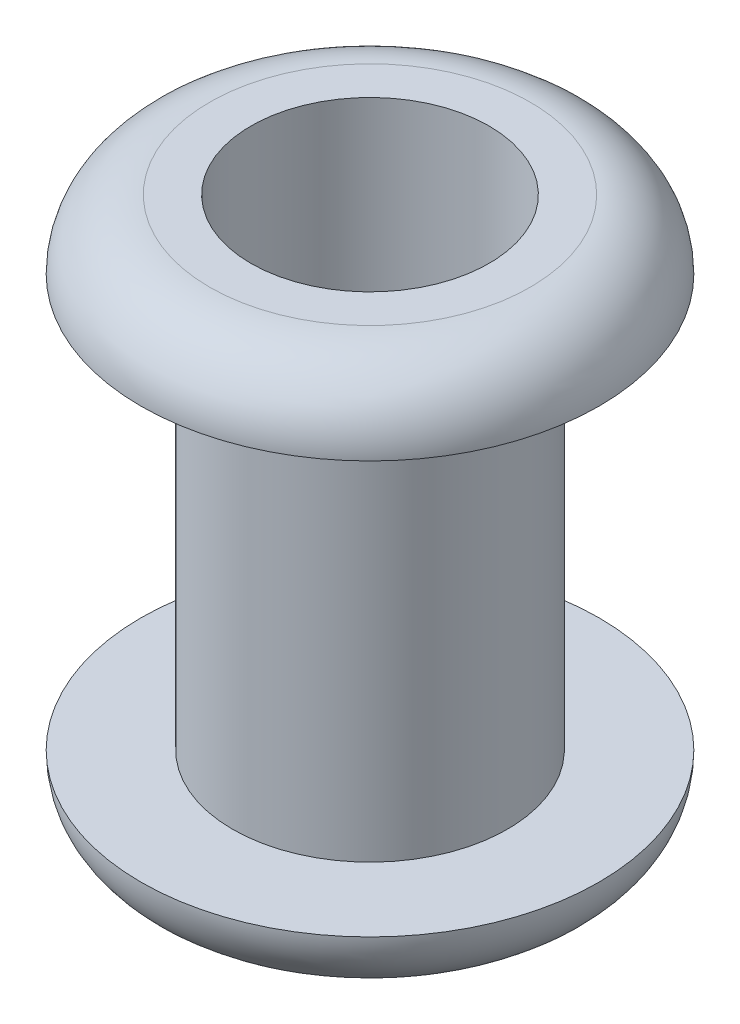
ISO-10303-21;
HEADER;
FILE_DESCRIPTION(('STEP AP214'),'2;1');
FILE_NAME('part.step','',(''),(''),'','','');
FILE_SCHEMA(('AUTOMOTIVE_DESIGN { 1 0 10303 214 1 1 1 1 }'));
ENDSEC;
DATA;
#1=APPLICATION_CONTEXT('core data for automotive mechanical design processes');
#2=APPLICATION_PROTOCOL_DEFINITION('international standard','automotive_design',2000,#1);
#3=PRODUCT_CONTEXT('',#1,'mechanical');
#4=PRODUCT('Part','Part','',(#3));
#5=PRODUCT_RELATED_PRODUCT_CATEGORY('part','',(#4));
#6=PRODUCT_DEFINITION_FORMATION('','',#4);
#7=PRODUCT_DEFINITION_CONTEXT('part definition',#1,'design');
#8=PRODUCT_DEFINITION('design','',#6,#7);
#9=PRODUCT_DEFINITION_SHAPE('','',#8);
#10=(LENGTH_UNIT() NAMED_UNIT(*) SI_UNIT(.MILLI.,.METRE.));
#11=(NAMED_UNIT(*) PLANE_ANGLE_UNIT() SI_UNIT($,.RADIAN.));
#12=(NAMED_UNIT(*) SI_UNIT($,.STERADIAN.) SOLID_ANGLE_UNIT());
#13=UNCERTAINTY_MEASURE_WITH_UNIT(LENGTH_MEASURE(1.E-05),#10,'distance_accuracy_value','');
#14=(GEOMETRIC_REPRESENTATION_CONTEXT(3) GLOBAL_UNCERTAINTY_ASSIGNED_CONTEXT((#13)) GLOBAL_UNIT_ASSIGNED_CONTEXT((#10,
#11,#12)) REPRESENTATION_CONTEXT('',''));
#15=CARTESIAN_POINT('',(0.,0.,0.));
#16=DIRECTION('',(0.,0.,1.));
#17=DIRECTION('',(1.,0.,0.));
#18=AXIS2_PLACEMENT_3D('',#15,#16,#17);
#19=CARTESIAN_POINT('',(0.,4.5,0.));
#20=DIRECTION('',(0.,-1.,0.));
#21=DIRECTION('',(0.,0.,-1.));
#22=AXIS2_PLACEMENT_3D('',#19,#20,#21);
#23=CYLINDRICAL_SURFACE('',#22,1.5);
#24=CARTESIAN_POINT('',(0.,4.5,0.));
#25=DIRECTION('',(0.,1.,0.));
#26=DIRECTION('',(0.,0.,1.));
#27=AXIS2_PLACEMENT_3D('',#24,#25,#26);
#28=CIRCLE('',#27,1.5);
#29=CARTESIAN_POINT('',(0.,4.5,1.5));
#30=VERTEX_POINT('',#29);
#31=EDGE_CURVE('E40',#30,#30,#28,.T.);
#32=ORIENTED_EDGE('',*,*,#31,.F.);
#33=EDGE_LOOP('',(#32));
#34=FACE_BOUND('',#33,.T.);
#35=CARTESIAN_POINT('',(0.,0.,0.));
#36=DIRECTION('',(0.,-1.,0.));
#37=DIRECTION('',(0.,0.,-1.));
#38=AXIS2_PLACEMENT_3D('',#35,#36,#37);
#39=CIRCLE('',#38,1.5);
#40=CARTESIAN_POINT('',(0.,0.,-1.5));
#41=VERTEX_POINT('',#40);
#42=EDGE_CURVE('E49',#41,#41,#39,.T.);
#43=ORIENTED_EDGE('',*,*,#42,.F.);
#44=EDGE_LOOP('',(#43));
#45=FACE_BOUND('',#44,.T.);
#46=ADVANCED_FACE('F29',(#34,#45),#23,.T.);
#47=CARTESIAN_POINT('',(0.,4.5,0.));
#48=DIRECTION('',(0.,1.,0.));
#49=DIRECTION('',(0.,0.,1.));
#50=AXIS2_PLACEMENT_3D('',#47,#48,#49);
#51=PLANE('',#50);
#52=CARTESIAN_POINT('',(0.,4.5,0.));
#53=DIRECTION('',(0.,1.,0.));
#54=DIRECTION('',(0.,0.,1.));
#55=AXIS2_PLACEMENT_3D('',#52,#53,#54);
#56=CIRCLE('',#55,2.5);
#57=CARTESIAN_POINT('',(0.,4.5,2.5));
#58=VERTEX_POINT('',#57);
#59=EDGE_CURVE('E44',#58,#58,#56,.T.);
#60=ORIENTED_EDGE('',*,*,#59,.F.);
#61=EDGE_LOOP('',(#60));
#62=FACE_BOUND('',#61,.T.);
#63=ORIENTED_EDGE('',*,*,#31,.T.);
#64=EDGE_LOOP('',(#63));
#65=FACE_BOUND('',#64,.T.);
#66=ADVANCED_FACE('F81',(#62,#65),#51,.F.);
#67=CARTESIAN_POINT('',(0.,5.25,0.));
#68=DIRECTION('',(0.,1.,0.));
#69=DIRECTION('',(0.,0.,1.));
#70=AXIS2_PLACEMENT_3D('',#67,#68,#69);
#71=PLANE('',#70);
#72=CARTESIAN_POINT('',(0.,5.25,0.));
#73=DIRECTION('',(0.,1.,0.));
#74=DIRECTION('',(0.,0.,1.));
#75=AXIS2_PLACEMENT_3D('',#72,#73,#74);
#76=CIRCLE('',#75,1.75);
#77=CARTESIAN_POINT('',(0.,5.25,1.75));
#78=VERTEX_POINT('',#77);
#79=EDGE_CURVE('E10',#78,#78,#76,.T.);
#80=ORIENTED_EDGE('',*,*,#79,.T.);
#81=EDGE_LOOP('',(#80));
#82=FACE_BOUND('',#81,.T.);
#83=CARTESIAN_POINT('',(0.,5.25,0.));
#84=DIRECTION('',(0.,-1.,0.));
#85=DIRECTION('',(0.,0.,-1.));
#86=AXIS2_PLACEMENT_3D('',#83,#84,#85);
#87=CIRCLE('',#86,1.3);
#88=CARTESIAN_POINT('',(0.,5.25,-1.3));
#89=VERTEX_POINT('',#88);
#90=EDGE_CURVE('E55',#89,#89,#87,.T.);
#91=ORIENTED_EDGE('',*,*,#90,.T.);
#92=EDGE_LOOP('',(#91));
#93=FACE_BOUND('',#92,.T.);
#94=ADVANCED_FACE('F62',(#82,#93),#71,.T.);
#95=CARTESIAN_POINT('',(0.,0.,0.));
#96=DIRECTION('',(0.,-1.,0.));
#97=DIRECTION('',(0.,0.,-1.));
#98=AXIS2_PLACEMENT_3D('',#95,#96,#97);
#99=PLANE('',#98);
#100=CARTESIAN_POINT('',(0.,0.,0.));
#101=DIRECTION('',(0.,-1.,0.));
#102=DIRECTION('',(0.,0.,-1.));
#103=AXIS2_PLACEMENT_3D('',#100,#101,#102);
#104=CIRCLE('',#103,2.5);
#105=CARTESIAN_POINT('',(0.,0.,-2.5));
#106=VERTEX_POINT('',#105);
#107=EDGE_CURVE('E52',#106,#106,#104,.T.);
#108=ORIENTED_EDGE('',*,*,#107,.F.);
#109=EDGE_LOOP('',(#108));
#110=FACE_BOUND('',#109,.T.);
#111=ORIENTED_EDGE('',*,*,#42,.T.);
#112=EDGE_LOOP('',(#111));
#113=FACE_BOUND('',#112,.T.);
#114=ADVANCED_FACE('F73',(#110,#113),#99,.F.);
#115=CARTESIAN_POINT('',(0.,-0.75,0.));
#116=DIRECTION('',(0.,-1.,0.));
#117=DIRECTION('',(0.,0.,-1.));
#118=AXIS2_PLACEMENT_3D('',#115,#116,#117);
#119=PLANE('',#118);
#120=CARTESIAN_POINT('',(0.,-0.75,0.));
#121=DIRECTION('',(0.,-1.,0.));
#122=DIRECTION('',(0.,0.,-1.));
#123=AXIS2_PLACEMENT_3D('',#120,#121,#122);
#124=CIRCLE('',#123,1.75);
#125=CARTESIAN_POINT('',(0.,-0.75,-1.75));
#126=VERTEX_POINT('',#125);
#127=EDGE_CURVE('E36',#126,#126,#124,.T.);
#128=ORIENTED_EDGE('',*,*,#127,.T.);
#129=EDGE_LOOP('',(#128));
#130=FACE_BOUND('',#129,.T.);
#131=CARTESIAN_POINT('',(0.,-0.75,0.));
#132=DIRECTION('',(0.,-1.,0.));
#133=DIRECTION('',(0.,0.,-1.));
#134=AXIS2_PLACEMENT_3D('',#131,#132,#133);
#135=CIRCLE('',#134,1.3);
#136=CARTESIAN_POINT('',(0.,-0.75,-1.3));
#137=VERTEX_POINT('',#136);
#138=EDGE_CURVE('E56',#137,#137,#135,.T.);
#139=ORIENTED_EDGE('',*,*,#138,.F.);
#140=EDGE_LOOP('',(#139));
#141=FACE_BOUND('',#140,.T.);
#142=ADVANCED_FACE('F68',(#130,#141),#119,.T.);
#143=CARTESIAN_POINT('',(0.,5.25,0.));
#144=DIRECTION('',(0.,-1.,0.));
#145=DIRECTION('',(0.,0.,-1.));
#146=AXIS2_PLACEMENT_3D('',#143,#144,#145);
#147=CYLINDRICAL_SURFACE('',#146,1.3);
#148=ORIENTED_EDGE('',*,*,#90,.F.);
#149=EDGE_LOOP('',(#148));
#150=FACE_BOUND('',#149,.T.);
#151=ORIENTED_EDGE('',*,*,#138,.T.);
#152=EDGE_LOOP('',(#151));
#153=FACE_BOUND('',#152,.T.);
#154=ADVANCED_FACE('F64',(#150,#153),#147,.F.);
#155=CARTESIAN_POINT('',(0.,0.,0.));
#156=DIRECTION('',(0.,-1.,0.));
#157=DIRECTION('',(0.,0.,-1.));
#158=AXIS2_PLACEMENT_3D('',#155,#156,#157);
#159=TOROIDAL_SURFACE('',#158,1.75,0.75);
#160=ORIENTED_EDGE('',*,*,#107,.T.);
#161=EDGE_LOOP('',(#160));
#162=FACE_BOUND('',#161,.T.);
#163=ORIENTED_EDGE('',*,*,#127,.F.);
#164=EDGE_LOOP('',(#163));
#165=FACE_BOUND('',#164,.T.);
#166=ADVANCED_FACE('F67',(#162,#165),#159,.T.);
#167=CARTESIAN_POINT('',(0.,4.5,0.));
#168=DIRECTION('',(0.,1.,0.));
#169=DIRECTION('',(0.,0.,1.));
#170=AXIS2_PLACEMENT_3D('',#167,#168,#169);
#171=TOROIDAL_SURFACE('',#170,1.75,0.75);
#172=ORIENTED_EDGE('',*,*,#59,.T.);
#173=EDGE_LOOP('',(#172));
#174=FACE_BOUND('',#173,.T.);
#175=ORIENTED_EDGE('',*,*,#79,.F.);
#176=EDGE_LOOP('',(#175));
#177=FACE_BOUND('',#176,.T.);
#178=ADVANCED_FACE('F31',(#174,#177),#171,.T.);
#179=CLOSED_SHELL('',(#46,#66,#94,#114,#142,#154,#166,#178));
#180=MANIFOLD_SOLID_BREP('B2',#179);
#181=ADVANCED_BREP_SHAPE_REPRESENTATION('',(#18,#180),#14);
#182=SHAPE_DEFINITION_REPRESENTATION(#9,#181);
ENDSEC;
END-ISO-10303-21;
